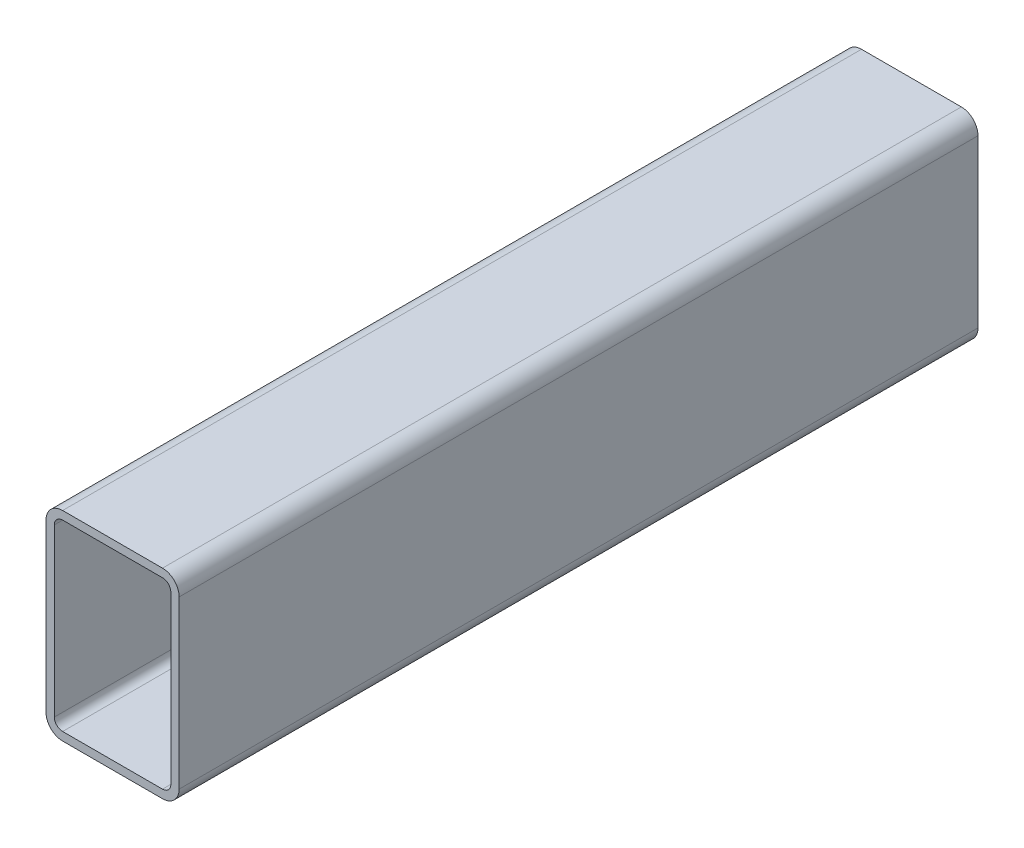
from build123d import *

# Parameters (mm, degrees)
BOSS_EXTRUDE1_DEPTH = 304.8


with BuildPart() as part:
    # Sketch1 → Boss-Extrude1 (new body)
    with BuildSketch(Plane.XY):
        with BuildLine():
            Line((6.35, 76.2), (44.45, 76.2))
            ThreePointArc((44.45, 76.2), (48.940128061, 74.340128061), (50.8, 69.85))
            Line((50.8, 69.85), (50.8, 6.35))
            ThreePointArc((50.8, 6.35), (48.940128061, 1.859871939), (44.45, 0))
            Line((44.45, 0), (6.35, 0))
            ThreePointArc((6.35, 0), (1.859871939, 1.859871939), (0, 6.35))
            Line((0, 6.35), (0, 69.85))
            ThreePointArc((0, 69.85), (1.859871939, 74.340128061), (6.35, 76.2))
        make_face()
        with BuildLine():
            Line((6.35, 73.025), (44.45, 73.025))
            ThreePointArc((44.45, 73.025), (46.69506403, 72.09506403), (47.625, 69.85))
            Line((47.625, 69.85), (47.625, 6.35))
            ThreePointArc((47.625, 6.35), (46.69506403, 4.10493597), (44.45, 3.175))
            Line((44.45, 3.175), (6.35, 3.175))
            ThreePointArc((6.35, 3.175), (4.10493597, 4.10493597), (3.175, 6.35))
            Line((3.175, 6.35), (3.175, 69.85))
            ThreePointArc((3.175, 69.85), (4.10493597, 72.09506403), (6.35, 73.025))
        make_face(mode=Mode.SUBTRACT)
    extrude(amount=BOSS_EXTRUDE1_DEPTH)


solid = part.part
